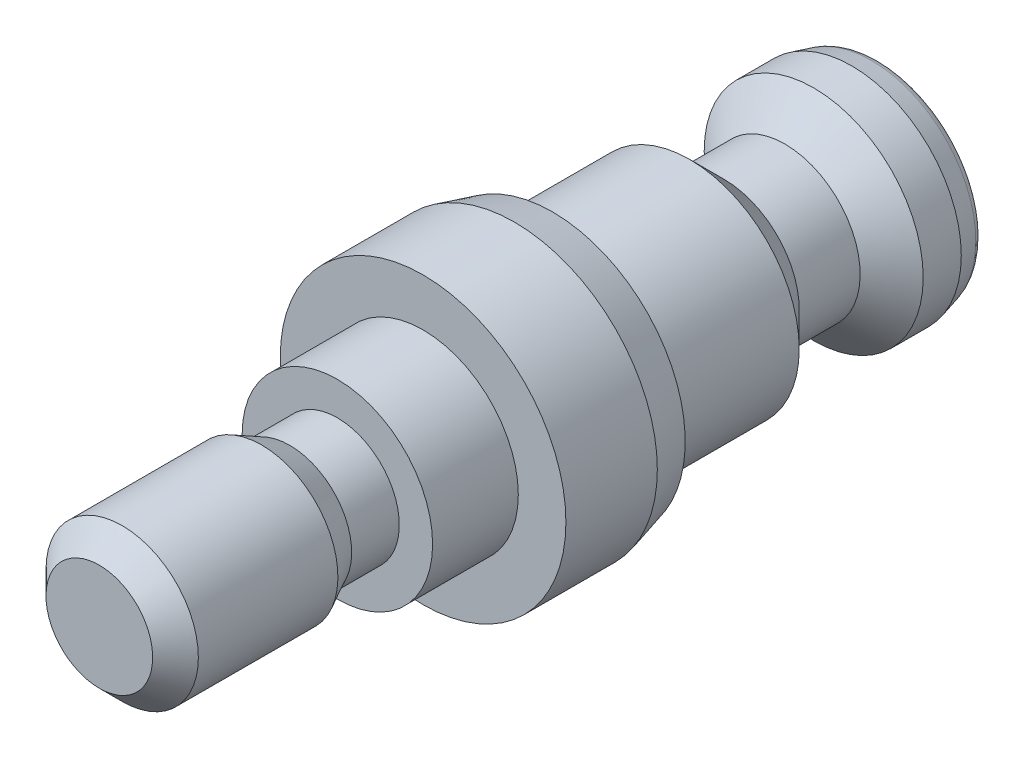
ISO-10303-21;
HEADER;
FILE_DESCRIPTION(('STEP AP214'),'2;1');
FILE_NAME('part.step','',(''),(''),'','','');
FILE_SCHEMA(('AUTOMOTIVE_DESIGN { 1 0 10303 214 1 1 1 1 }'));
ENDSEC;
DATA;
#1=APPLICATION_CONTEXT('core data for automotive mechanical design processes');
#2=APPLICATION_PROTOCOL_DEFINITION('international standard','automotive_design',2000,#1);
#3=PRODUCT_CONTEXT('',#1,'mechanical');
#4=PRODUCT('Part','Part','',(#3));
#5=PRODUCT_RELATED_PRODUCT_CATEGORY('part','',(#4));
#6=PRODUCT_DEFINITION_FORMATION('','',#4);
#7=PRODUCT_DEFINITION_CONTEXT('part definition',#1,'design');
#8=PRODUCT_DEFINITION('design','',#6,#7);
#9=PRODUCT_DEFINITION_SHAPE('','',#8);
#10=(LENGTH_UNIT() NAMED_UNIT(*) SI_UNIT(.MILLI.,.METRE.));
#11=(NAMED_UNIT(*) PLANE_ANGLE_UNIT() SI_UNIT($,.RADIAN.));
#12=(NAMED_UNIT(*) SI_UNIT($,.STERADIAN.) SOLID_ANGLE_UNIT());
#13=UNCERTAINTY_MEASURE_WITH_UNIT(LENGTH_MEASURE(1.E-05),#10,'distance_accuracy_value','');
#14=(GEOMETRIC_REPRESENTATION_CONTEXT(3) GLOBAL_UNCERTAINTY_ASSIGNED_CONTEXT((#13)) GLOBAL_UNIT_ASSIGNED_CONTEXT((#10,
#11,#12)) REPRESENTATION_CONTEXT('',''));
#15=CARTESIAN_POINT('',(0.,0.,0.));
#16=DIRECTION('',(0.,0.,1.));
#17=DIRECTION('',(1.,0.,0.));
#18=AXIS2_PLACEMENT_3D('',#15,#16,#17);
#19=CARTESIAN_POINT('',(0.,0.,0.));
#20=DIRECTION('',(0.,0.,-1.));
#21=DIRECTION('',(0.,1.,0.));
#22=AXIS2_PLACEMENT_3D('',#19,#20,#21);
#23=CYLINDRICAL_SURFACE('',#22,5.75);
#24=CARTESIAN_POINT('',(0.,0.,-14.));
#25=DIRECTION('',(0.,0.,-1.));
#26=DIRECTION('',(0.,1.,0.));
#27=AXIS2_PLACEMENT_3D('',#24,#25,#26);
#28=CIRCLE('',#27,5.75);
#29=CARTESIAN_POINT('',(0.,5.75000000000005,-14.));
#30=VERTEX_POINT('',#29);
#31=EDGE_CURVE('E151',#30,#30,#28,.T.);
#32=ORIENTED_EDGE('',*,*,#31,.F.);
#33=EDGE_LOOP('',(#32));
#34=FACE_BOUND('',#33,.T.);
#35=CARTESIAN_POINT('',(0.,0.,-6.8));
#36=DIRECTION('',(0.,0.,1.));
#37=DIRECTION('',(0.,-1.,0.));
#38=AXIS2_PLACEMENT_3D('',#35,#36,#37);
#39=CIRCLE('',#38,5.75);
#40=CARTESIAN_POINT('',(0.,-5.74999999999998,-6.80000000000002));
#41=VERTEX_POINT('',#40);
#42=EDGE_CURVE('E136',#41,#41,#39,.T.);
#43=ORIENTED_EDGE('',*,*,#42,.F.);
#44=EDGE_LOOP('',(#43));
#45=FACE_BOUND('',#44,.T.);
#46=ADVANCED_FACE('F14',(#34,#45),#23,.T.);
#47=CARTESIAN_POINT('',(0.,0.,-15.8));
#48=DIRECTION('',(0.,0.,1.));
#49=DIRECTION('',(0.,-1.,0.));
#50=AXIS2_PLACEMENT_3D('',#47,#48,#49);
#51=CONICAL_SURFACE('',#50,3.95,0.785398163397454);
#52=ORIENTED_EDGE('',*,*,#31,.T.);
#53=EDGE_LOOP('',(#52));
#54=FACE_BOUND('',#53,.T.);
#55=CARTESIAN_POINT('',(0.,0.,-15.8));
#56=DIRECTION('',(0.,0.,-1.));
#57=DIRECTION('',(0.,1.,0.));
#58=AXIS2_PLACEMENT_3D('',#55,#56,#57);
#59=CIRCLE('',#58,3.95);
#60=CARTESIAN_POINT('',(0.,3.95000000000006,-15.8));
#61=VERTEX_POINT('',#60);
#62=EDGE_CURVE('E148',#61,#61,#59,.T.);
#63=ORIENTED_EDGE('',*,*,#62,.F.);
#64=EDGE_LOOP('',(#63));
#65=FACE_BOUND('',#64,.T.);
#66=ADVANCED_FACE('F185',(#54,#65),#51,.T.);
#67=CARTESIAN_POINT('',(0.,0.,0.));
#68=DIRECTION('',(0.,0.,-1.));
#69=DIRECTION('',(0.,1.,0.));
#70=AXIS2_PLACEMENT_3D('',#67,#68,#69);
#71=CYLINDRICAL_SURFACE('',#70,3.95);
#72=ORIENTED_EDGE('',*,*,#62,.T.);
#73=EDGE_LOOP('',(#72));
#74=FACE_BOUND('',#73,.T.);
#75=CARTESIAN_POINT('',(0.,0.,-19.));
#76=DIRECTION('',(0.,0.,-1.));
#77=DIRECTION('',(0.,1.,0.));
#78=AXIS2_PLACEMENT_3D('',#75,#76,#77);
#79=CIRCLE('',#78,3.95);
#80=CARTESIAN_POINT('',(0.,3.95000000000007,-19.));
#81=VERTEX_POINT('',#80);
#82=EDGE_CURVE('E145',#81,#81,#79,.T.);
#83=ORIENTED_EDGE('',*,*,#82,.F.);
#84=EDGE_LOOP('',(#83));
#85=FACE_BOUND('',#84,.T.);
#86=ADVANCED_FACE('F192',(#74,#85),#71,.T.);
#87=CARTESIAN_POINT('',(0.,0.,-20.5103793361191));
#88=DIRECTION('',(0.,0.,-1.));
#89=DIRECTION('',(0.,1.,0.));
#90=AXIS2_PLACEMENT_3D('',#87,#88,#89);
#91=CONICAL_SURFACE('',#90,5.75,0.872664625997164);
#92=ORIENTED_EDGE('',*,*,#82,.T.);
#93=EDGE_LOOP('',(#92));
#94=FACE_BOUND('',#93,.T.);
#95=CARTESIAN_POINT('',(0.,0.,-20.5103793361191));
#96=DIRECTION('',(0.,0.,-1.));
#97=DIRECTION('',(0.,1.,0.));
#98=AXIS2_PLACEMENT_3D('',#95,#96,#97);
#99=CIRCLE('',#98,5.75);
#100=CARTESIAN_POINT('',(0.,5.75000000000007,-20.5103793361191));
#101=VERTEX_POINT('',#100);
#102=EDGE_CURVE('E142',#101,#101,#99,.T.);
#103=ORIENTED_EDGE('',*,*,#102,.F.);
#104=EDGE_LOOP('',(#103));
#105=FACE_BOUND('',#104,.T.);
#106=ADVANCED_FACE('F244',(#94,#105),#91,.T.);
#107=CARTESIAN_POINT('',(0.,0.,0.));
#108=DIRECTION('',(0.,0.,-1.));
#109=DIRECTION('',(0.,1.,0.));
#110=AXIS2_PLACEMENT_3D('',#107,#108,#109);
#111=CYLINDRICAL_SURFACE('',#110,5.75);
#112=ORIENTED_EDGE('',*,*,#102,.T.);
#113=EDGE_LOOP('',(#112));
#114=FACE_BOUND('',#113,.T.);
#115=CARTESIAN_POINT('',(0.,0.,-22.5103793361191));
#116=DIRECTION('',(0.,0.,-1.));
#117=DIRECTION('',(0.,1.,0.));
#118=AXIS2_PLACEMENT_3D('',#115,#116,#117);
#119=CIRCLE('',#118,5.75);
#120=CARTESIAN_POINT('',(0.,5.75000000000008,-22.5103793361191));
#121=VERTEX_POINT('',#120);
#122=EDGE_CURVE('E139',#121,#121,#119,.T.);
#123=ORIENTED_EDGE('',*,*,#122,.F.);
#124=EDGE_LOOP('',(#123));
#125=FACE_BOUND('',#124,.T.);
#126=ADVANCED_FACE('F235',(#114,#125),#111,.T.);
#127=CARTESIAN_POINT('',(0.,0.,-24.));
#128=DIRECTION('',(0.,0.,1.));
#129=DIRECTION('',(0.,-1.,0.));
#130=AXIS2_PLACEMENT_3D('',#127,#128,#129);
#131=CONICAL_SURFACE('',#130,5.3508573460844,0.26179938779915);
#132=CARTESIAN_POINT('',(0.,0.,-23.5552914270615));
#133=DIRECTION('',(0.,0.,-1.));
#134=DIRECTION('',(0.,1.,0.));
#135=AXIS2_PLACEMENT_3D('',#132,#133,#134);
#136=CIRCLE('',#135,5.47001664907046);
#137=CARTESIAN_POINT('',(0.,5.47001664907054,-23.5552914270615));
#138=VERTEX_POINT('',#137);
#139=EDGE_CURVE('E166',#138,#138,#136,.F.);
#140=ORIENTED_EDGE('',*,*,#139,.T.);
#141=EDGE_LOOP('',(#140));
#142=FACE_BOUND('',#141,.T.);
#143=ORIENTED_EDGE('',*,*,#122,.T.);
#144=EDGE_LOOP('',(#143));
#145=FACE_BOUND('',#144,.T.);
#146=ADVANCED_FACE('F225',(#142,#145),#131,.T.);
#147=CARTESIAN_POINT('',(5.3508573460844,0.,-24.));
#148=DIRECTION('',(0.,0.,-1.));
#149=DIRECTION('',(0.,1.,0.));
#150=AXIS2_PLACEMENT_3D('',#147,#148,#149);
#151=PLANE('',#150);
#152=DIRECTION('',(0.5,-0.86602540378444,0.));
#153=VECTOR('',#152,1.);
#154=CARTESIAN_POINT('',(1.15470053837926,2.00000000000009,-24.));
#155=LINE('',#154,#153);
#156=CARTESIAN_POINT('',(1.15470053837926,2.00000000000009,-24.));
#157=VERTEX_POINT('',#156);
#158=CARTESIAN_POINT('',(2.3094010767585,0.,-24.));
#159=VERTEX_POINT('',#158);
#160=EDGE_CURVE('E29',#157,#159,#155,.T.);
#161=ORIENTED_EDGE('',*,*,#160,.F.);
#162=DIRECTION('',(1.,0.,0.));
#163=VECTOR('',#162,1.);
#164=CARTESIAN_POINT('',(-1.15470053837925,2.00000000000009,-24.));
#165=LINE('',#164,#163);
#166=CARTESIAN_POINT('',(-1.15470053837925,2.00000000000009,-24.));
#167=VERTEX_POINT('',#166);
#168=EDGE_CURVE('E112',#167,#157,#165,.T.);
#169=ORIENTED_EDGE('',*,*,#168,.F.);
#170=DIRECTION('',(0.5,0.866025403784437,0.));
#171=VECTOR('',#170,1.);
#172=CARTESIAN_POINT('',(-2.30940107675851,0.,-24.));
#173=LINE('',#172,#171);
#174=CARTESIAN_POINT('',(-2.30940107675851,0.,-24.));
#175=VERTEX_POINT('',#174);
#176=EDGE_CURVE('E110',#175,#167,#173,.T.);
#177=ORIENTED_EDGE('',*,*,#176,.F.);
#178=DIRECTION('',(-0.5,0.866025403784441,0.));
#179=VECTOR('',#178,1.);
#180=CARTESIAN_POINT('',(-1.15470053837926,-1.99999999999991,-24.));
#181=LINE('',#180,#179);
#182=CARTESIAN_POINT('',(-1.15470053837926,-1.99999999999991,-24.));
#183=VERTEX_POINT('',#182);
#184=EDGE_CURVE('E77',#183,#175,#181,.T.);
#185=ORIENTED_EDGE('',*,*,#184,.F.);
#186=DIRECTION('',(-1.,0.,0.));
#187=VECTOR('',#186,1.);
#188=CARTESIAN_POINT('',(1.15470053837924,-1.99999999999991,-24.));
#189=LINE('',#188,#187);
#190=CARTESIAN_POINT('',(1.15470053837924,-1.99999999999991,-24.));
#191=VERTEX_POINT('',#190);
#192=EDGE_CURVE('E106',#191,#183,#189,.T.);
#193=ORIENTED_EDGE('',*,*,#192,.F.);
#194=DIRECTION('',(-0.5,-0.866025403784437,0.));
#195=VECTOR('',#194,1.);
#196=CARTESIAN_POINT('',(2.3094010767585,0.,-24.));
#197=LINE('',#196,#195);
#198=EDGE_CURVE('E103',#159,#191,#197,.T.);
#199=ORIENTED_EDGE('',*,*,#198,.F.);
#200=EDGE_LOOP('',(#161,#169,#177,#185,#193,#199));
#201=FACE_BOUND('',#200,.T.);
#202=CARTESIAN_POINT('',(0.,0.,-24.));
#203=DIRECTION('',(0.,0.,-1.));
#204=DIRECTION('',(0.,1.,0.));
#205=AXIS2_PLACEMENT_3D('',#202,#203,#204);
#206=CIRCLE('',#205,4.89046115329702);
#207=CARTESIAN_POINT('',(0.,4.8904611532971,-24.));
#208=VERTEX_POINT('',#207);
#209=EDGE_CURVE('E163',#208,#208,#206,.T.);
#210=ORIENTED_EDGE('',*,*,#209,.T.);
#211=EDGE_LOOP('',(#210));
#212=FACE_BOUND('',#211,.T.);
#213=ADVANCED_FACE('F222',(#201,#212),#151,.T.);
#214=CARTESIAN_POINT('',(5.75,0.,-6.8));
#215=DIRECTION('',(0.,0.,1.));
#216=DIRECTION('',(0.,-1.,0.));
#217=AXIS2_PLACEMENT_3D('',#214,#215,#216);
#218=PLANE('',#217);
#219=CARTESIAN_POINT('',(0.,0.,-6.8));
#220=DIRECTION('',(0.,0.,1.));
#221=DIRECTION('',(0.,-1.,0.));
#222=AXIS2_PLACEMENT_3D('',#219,#220,#221);
#223=CIRCLE('',#222,6.96410161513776);
#224=CARTESIAN_POINT('',(0.,-6.96410161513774,-6.80000000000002));
#225=VERTEX_POINT('',#224);
#226=EDGE_CURVE('E9',#225,#225,#223,.F.);
#227=ORIENTED_EDGE('',*,*,#226,.T.);
#228=EDGE_LOOP('',(#227));
#229=FACE_BOUND('',#228,.T.);
#230=ORIENTED_EDGE('',*,*,#42,.T.);
#231=EDGE_LOOP('',(#230));
#232=FACE_BOUND('',#231,.T.);
#233=ADVANCED_FACE('F224',(#229,#232),#218,.F.);
#234=CARTESIAN_POINT('',(0.,0.,0.));
#235=DIRECTION('',(0.,0.,1.));
#236=DIRECTION('',(0.,-1.,0.));
#237=AXIS2_PLACEMENT_3D('',#234,#235,#236);
#238=CYLINDRICAL_SURFACE('',#237,7.5);
#239=CARTESIAN_POINT('',(0.,0.,-4.8));
#240=DIRECTION('',(0.,0.,1.));
#241=DIRECTION('',(0.,-1.,0.));
#242=AXIS2_PLACEMENT_3D('',#239,#240,#241);
#243=CIRCLE('',#242,7.5);
#244=CARTESIAN_POINT('',(0.,-7.49999999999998,-4.80000000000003));
#245=VERTEX_POINT('',#244);
#246=EDGE_CURVE('E22',#245,#245,#243,.T.);
#247=ORIENTED_EDGE('',*,*,#246,.T.);
#248=EDGE_LOOP('',(#247));
#249=FACE_BOUND('',#248,.T.);
#250=CARTESIAN_POINT('',(0.,0.,0.));
#251=DIRECTION('',(0.,0.,1.));
#252=DIRECTION('',(0.,-1.,0.));
#253=AXIS2_PLACEMENT_3D('',#250,#251,#252);
#254=CIRCLE('',#253,7.5);
#255=CARTESIAN_POINT('',(0.,-7.5,0.));
#256=VERTEX_POINT('',#255);
#257=EDGE_CURVE('E133',#256,#256,#254,.T.);
#258=ORIENTED_EDGE('',*,*,#257,.F.);
#259=EDGE_LOOP('',(#258));
#260=FACE_BOUND('',#259,.T.);
#261=ADVANCED_FACE('F171',(#249,#260),#238,.T.);
#262=CARTESIAN_POINT('',(0.,0.,0.));
#263=DIRECTION('',(0.,0.,1.));
#264=DIRECTION('',(0.,-1.,0.));
#265=AXIS2_PLACEMENT_3D('',#262,#263,#264);
#266=PLANE('',#265);
#267=CARTESIAN_POINT('',(0.,0.,0.));
#268=DIRECTION('',(0.,0.,1.));
#269=DIRECTION('',(0.,-1.,0.));
#270=AXIS2_PLACEMENT_3D('',#267,#268,#269);
#271=CIRCLE('',#270,5.);
#272=CARTESIAN_POINT('',(0.,-5.,0.));
#273=VERTEX_POINT('',#272);
#274=EDGE_CURVE('E154',#273,#273,#271,.T.);
#275=ORIENTED_EDGE('',*,*,#274,.F.);
#276=EDGE_LOOP('',(#275));
#277=FACE_BOUND('',#276,.T.);
#278=ORIENTED_EDGE('',*,*,#257,.T.);
#279=EDGE_LOOP('',(#278));
#280=FACE_BOUND('',#279,.T.);
#281=ADVANCED_FACE('F199',(#277,#280),#266,.T.);
#282=CARTESIAN_POINT('',(4.,0.,4.5));
#283=DIRECTION('',(0.,0.,1.));
#284=DIRECTION('',(0.,-1.,0.));
#285=AXIS2_PLACEMENT_3D('',#282,#283,#284);
#286=PLANE('',#285);
#287=CARTESIAN_POINT('',(0.,0.,4.5));
#288=DIRECTION('',(0.,0.,-1.));
#289=DIRECTION('',(0.,1.,0.));
#290=AXIS2_PLACEMENT_3D('',#287,#288,#289);
#291=CIRCLE('',#290,5.);
#292=CARTESIAN_POINT('',(0.,4.99999999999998,4.50000000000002));
#293=VERTEX_POINT('',#292);
#294=EDGE_CURVE('E130',#293,#293,#291,.T.);
#295=ORIENTED_EDGE('',*,*,#294,.F.);
#296=EDGE_LOOP('',(#295));
#297=FACE_BOUND('',#296,.T.);
#298=CARTESIAN_POINT('',(0.,0.,4.5));
#299=DIRECTION('',(0.,0.,-1.));
#300=DIRECTION('',(0.,1.,0.));
#301=AXIS2_PLACEMENT_3D('',#298,#299,#300);
#302=CIRCLE('',#301,3.25);
#303=CARTESIAN_POINT('',(0.,3.24999999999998,4.50000000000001));
#304=VERTEX_POINT('',#303);
#305=EDGE_CURVE('E116',#304,#304,#302,.T.);
#306=ORIENTED_EDGE('',*,*,#305,.T.);
#307=EDGE_LOOP('',(#306));
#308=FACE_BOUND('',#307,.T.);
#309=ADVANCED_FACE('F202',(#297,#308),#286,.T.);
#310=CARTESIAN_POINT('',(0.,0.,0.));
#311=DIRECTION('',(0.,0.,-1.));
#312=DIRECTION('',(0.,1.,0.));
#313=AXIS2_PLACEMENT_3D('',#310,#311,#312);
#314=CYLINDRICAL_SURFACE('',#313,5.);
#315=ORIENTED_EDGE('',*,*,#294,.T.);
#316=EDGE_LOOP('',(#315));
#317=FACE_BOUND('',#316,.T.);
#318=ORIENTED_EDGE('',*,*,#274,.T.);
#319=EDGE_LOOP('',(#318));
#320=FACE_BOUND('',#319,.T.);
#321=ADVANCED_FACE('F411',(#317,#320),#314,.T.);
#322=CARTESIAN_POINT('',(0.,0.,8.47195787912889));
#323=DIRECTION('',(0.,0.,1.));
#324=DIRECTION('',(0.,-1.,0.));
#325=AXIS2_PLACEMENT_3D('',#322,#323,#324);
#326=CONICAL_SURFACE('',#325,4.,0.471238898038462);
#327=CARTESIAN_POINT('',(0.,0.,7.));
#328=DIRECTION('',(0.,0.,-1.));
#329=DIRECTION('',(0.,1.,0.));
#330=AXIS2_PLACEMENT_3D('',#327,#328,#329);
#331=CIRCLE('',#330,3.25);
#332=CARTESIAN_POINT('',(0.,3.24999999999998,7.00000000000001));
#333=VERTEX_POINT('',#332);
#334=EDGE_CURVE('E124',#333,#333,#331,.T.);
#335=ORIENTED_EDGE('',*,*,#334,.F.);
#336=EDGE_LOOP('',(#335));
#337=FACE_BOUND('',#336,.T.);
#338=CARTESIAN_POINT('',(0.,0.,8.47195787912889));
#339=DIRECTION('',(0.,0.,-1.));
#340=DIRECTION('',(0.,1.,0.));
#341=AXIS2_PLACEMENT_3D('',#338,#339,#340);
#342=CIRCLE('',#341,4.);
#343=CARTESIAN_POINT('',(0.,3.99999999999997,8.4719578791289));
#344=VERTEX_POINT('',#343);
#345=EDGE_CURVE('E127',#344,#344,#342,.T.);
#346=ORIENTED_EDGE('',*,*,#345,.T.);
#347=EDGE_LOOP('',(#346));
#348=FACE_BOUND('',#347,.T.);
#349=ADVANCED_FACE('F401',(#337,#348),#326,.T.);
#350=CARTESIAN_POINT('',(0.,0.,0.));
#351=DIRECTION('',(0.,0.,-1.));
#352=DIRECTION('',(0.,1.,0.));
#353=AXIS2_PLACEMENT_3D('',#350,#351,#352);
#354=CYLINDRICAL_SURFACE('',#353,3.25);
#355=ORIENTED_EDGE('',*,*,#305,.F.);
#356=EDGE_LOOP('',(#355));
#357=FACE_BOUND('',#356,.T.);
#358=ORIENTED_EDGE('',*,*,#334,.T.);
#359=EDGE_LOOP('',(#358));
#360=FACE_BOUND('',#359,.T.);
#361=ADVANCED_FACE('F392',(#357,#360),#354,.T.);
#362=CARTESIAN_POINT('',(0.,0.,17.));
#363=DIRECTION('',(0.,0.,1.));
#364=DIRECTION('',(0.,-1.,0.));
#365=AXIS2_PLACEMENT_3D('',#362,#363,#364);
#366=PLANE('',#365);
#367=CARTESIAN_POINT('',(0.,0.,17.));
#368=DIRECTION('',(0.,0.,1.));
#369=DIRECTION('',(0.,-1.,0.));
#370=AXIS2_PLACEMENT_3D('',#367,#368,#369);
#371=CIRCLE('',#370,2.8);
#372=CARTESIAN_POINT('',(0.,-2.80000000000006,17.));
#373=VERTEX_POINT('',#372);
#374=EDGE_CURVE('E160',#373,#373,#371,.T.);
#375=ORIENTED_EDGE('',*,*,#374,.T.);
#376=EDGE_LOOP('',(#375));
#377=FACE_BOUND('',#376,.T.);
#378=ADVANCED_FACE('F239',(#377),#366,.T.);
#379=CARTESIAN_POINT('',(0.,0.,0.));
#380=DIRECTION('',(0.,0.,-1.));
#381=DIRECTION('',(0.,1.,0.));
#382=AXIS2_PLACEMENT_3D('',#379,#380,#381);
#383=CYLINDRICAL_SURFACE('',#382,4.);
#384=CARTESIAN_POINT('',(0.,0.,15.8));
#385=DIRECTION('',(0.,0.,1.));
#386=DIRECTION('',(0.,-1.,0.));
#387=AXIS2_PLACEMENT_3D('',#384,#385,#386);
#388=CIRCLE('',#387,4.);
#389=CARTESIAN_POINT('',(0.,-4.00000000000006,15.8));
#390=VERTEX_POINT('',#389);
#391=EDGE_CURVE('E157',#390,#390,#388,.F.);
#392=ORIENTED_EDGE('',*,*,#391,.T.);
#393=EDGE_LOOP('',(#392));
#394=FACE_BOUND('',#393,.T.);
#395=ORIENTED_EDGE('',*,*,#345,.F.);
#396=EDGE_LOOP('',(#395));
#397=FACE_BOUND('',#396,.T.);
#398=ADVANCED_FACE('F207',(#394,#397),#383,.T.);
#399=CARTESIAN_POINT('',(0.,0.,15.8));
#400=DIRECTION('',(0.,0.,-1.));
#401=DIRECTION('',(0.,1.,0.));
#402=AXIS2_PLACEMENT_3D('',#399,#400,#401);
#403=CONICAL_SURFACE('',#402,4.,0.78539816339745);
#404=ORIENTED_EDGE('',*,*,#374,.F.);
#405=EDGE_LOOP('',(#404));
#406=FACE_BOUND('',#405,.T.);
#407=ORIENTED_EDGE('',*,*,#391,.F.);
#408=EDGE_LOOP('',(#407));
#409=FACE_BOUND('',#408,.T.);
#410=ADVANCED_FACE('F204',(#406,#409),#403,.T.);
#411=CARTESIAN_POINT('',(0.,0.,-23.4));
#412=DIRECTION('',(0.,0.,-1.));
#413=DIRECTION('',(0.,1.,0.));
#414=AXIS2_PLACEMENT_3D('',#411,#412,#413);
#415=TOROIDAL_SURFACE('',#414,4.89046115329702,0.6);
#416=ORIENTED_EDGE('',*,*,#139,.F.);
#417=EDGE_LOOP('',(#416));
#418=FACE_BOUND('',#417,.T.);
#419=ORIENTED_EDGE('',*,*,#209,.F.);
#420=EDGE_LOOP('',(#419));
#421=FACE_BOUND('',#420,.T.);
#422=ADVANCED_FACE('F206',(#418,#421),#415,.T.);
#423=CARTESIAN_POINT('',(1.15470053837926,2.00000000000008,-21.));
#424=DIRECTION('',(0.86602540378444,0.5,0.));
#425=DIRECTION('',(-0.5,0.86602540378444,0.));
#426=AXIS2_PLACEMENT_3D('',#423,#424,#425);
#427=PLANE('',#426);
#428=ORIENTED_EDGE('',*,*,#160,.T.);
#429=DIRECTION('',(0.,0.,-1.));
#430=VECTOR('',#429,1.);
#431=CARTESIAN_POINT('',(2.3094010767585,0.,-21.));
#432=LINE('',#431,#430);
#433=CARTESIAN_POINT('',(2.3094010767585,0.,-21.));
#434=VERTEX_POINT('',#433);
#435=EDGE_CURVE('E59',#434,#159,#432,.T.);
#436=ORIENTED_EDGE('',*,*,#435,.F.);
#437=DIRECTION('',(0.5,-0.86602540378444,0.));
#438=VECTOR('',#437,1.);
#439=CARTESIAN_POINT('',(1.15470053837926,2.00000000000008,-21.));
#440=LINE('',#439,#438);
#441=CARTESIAN_POINT('',(1.15470053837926,2.00000000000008,-21.));
#442=VERTEX_POINT('',#441);
#443=EDGE_CURVE('E114',#442,#434,#440,.T.);
#444=ORIENTED_EDGE('',*,*,#443,.F.);
#445=DIRECTION('',(0.,0.,-1.));
#446=VECTOR('',#445,1.);
#447=CARTESIAN_POINT('',(1.15470053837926,2.00000000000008,-21.));
#448=LINE('',#447,#446);
#449=EDGE_CURVE('E37',#442,#157,#448,.T.);
#450=ORIENTED_EDGE('',*,*,#449,.T.);
#451=EDGE_LOOP('',(#428,#436,#444,#450));
#452=FACE_BOUND('',#451,.T.);
#453=ADVANCED_FACE('F210',(#452),#427,.F.);
#454=CARTESIAN_POINT('',(-1.15470053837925,2.00000000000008,-21.));
#455=DIRECTION('',(0.,1.,0.));
#456=DIRECTION('',(-1.,0.,0.));
#457=AXIS2_PLACEMENT_3D('',#454,#455,#456);
#458=PLANE('',#457);
#459=ORIENTED_EDGE('',*,*,#168,.T.);
#460=ORIENTED_EDGE('',*,*,#449,.F.);
#461=DIRECTION('',(1.,0.,0.));
#462=VECTOR('',#461,1.);
#463=CARTESIAN_POINT('',(-1.15470053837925,2.00000000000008,-21.));
#464=LINE('',#463,#462);
#465=CARTESIAN_POINT('',(-1.15470053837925,2.00000000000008,-21.));
#466=VERTEX_POINT('',#465);
#467=EDGE_CURVE('E89',#466,#442,#464,.T.);
#468=ORIENTED_EDGE('',*,*,#467,.F.);
#469=DIRECTION('',(0.,0.,-1.));
#470=VECTOR('',#469,1.);
#471=CARTESIAN_POINT('',(-1.15470053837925,2.00000000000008,-21.));
#472=LINE('',#471,#470);
#473=EDGE_CURVE('E81',#466,#167,#472,.T.);
#474=ORIENTED_EDGE('',*,*,#473,.T.);
#475=EDGE_LOOP('',(#459,#460,#468,#474));
#476=FACE_BOUND('',#475,.T.);
#477=ADVANCED_FACE('F216',(#476),#458,.F.);
#478=CARTESIAN_POINT('',(-2.30940107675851,0.,-21.));
#479=DIRECTION('',(-0.866025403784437,0.5,0.));
#480=DIRECTION('',(-0.5,-0.866025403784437,0.));
#481=AXIS2_PLACEMENT_3D('',#478,#479,#480);
#482=PLANE('',#481);
#483=ORIENTED_EDGE('',*,*,#176,.T.);
#484=ORIENTED_EDGE('',*,*,#473,.F.);
#485=DIRECTION('',(0.5,0.866025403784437,0.));
#486=VECTOR('',#485,1.);
#487=CARTESIAN_POINT('',(-2.30940107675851,0.,-21.));
#488=LINE('',#487,#486);
#489=CARTESIAN_POINT('',(-2.30940107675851,0.,-21.));
#490=VERTEX_POINT('',#489);
#491=EDGE_CURVE('E85',#490,#466,#488,.T.);
#492=ORIENTED_EDGE('',*,*,#491,.F.);
#493=DIRECTION('',(0.,0.,-1.));
#494=VECTOR('',#493,1.);
#495=CARTESIAN_POINT('',(-2.30940107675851,0.,-21.));
#496=LINE('',#495,#494);
#497=EDGE_CURVE('E70',#490,#175,#496,.T.);
#498=ORIENTED_EDGE('',*,*,#497,.T.);
#499=EDGE_LOOP('',(#483,#484,#492,#498));
#500=FACE_BOUND('',#499,.T.);
#501=ADVANCED_FACE('F86',(#500),#482,.F.);
#502=CARTESIAN_POINT('',(-1.15470053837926,-1.99999999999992,-21.));
#503=DIRECTION('',(-0.86602540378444,-0.5,0.));
#504=DIRECTION('',(0.5,-0.866025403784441,0.));
#505=AXIS2_PLACEMENT_3D('',#502,#503,#504);
#506=PLANE('',#505);
#507=ORIENTED_EDGE('',*,*,#184,.T.);
#508=ORIENTED_EDGE('',*,*,#497,.F.);
#509=DIRECTION('',(-0.5,0.866025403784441,0.));
#510=VECTOR('',#509,1.);
#511=CARTESIAN_POINT('',(-1.15470053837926,-1.99999999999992,-21.));
#512=LINE('',#511,#510);
#513=CARTESIAN_POINT('',(-1.15470053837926,-1.99999999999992,-21.));
#514=VERTEX_POINT('',#513);
#515=EDGE_CURVE('E74',#514,#490,#512,.T.);
#516=ORIENTED_EDGE('',*,*,#515,.F.);
#517=DIRECTION('',(0.,0.,-1.));
#518=VECTOR('',#517,1.);
#519=CARTESIAN_POINT('',(-1.15470053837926,-1.99999999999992,-21.));
#520=LINE('',#519,#518);
#521=EDGE_CURVE('E82',#514,#183,#520,.T.);
#522=ORIENTED_EDGE('',*,*,#521,.T.);
#523=EDGE_LOOP('',(#507,#508,#516,#522));
#524=FACE_BOUND('',#523,.T.);
#525=ADVANCED_FACE('F72',(#524),#506,.F.);
#526=CARTESIAN_POINT('',(1.15470053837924,-1.99999999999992,-21.));
#527=DIRECTION('',(0.,-1.,0.));
#528=DIRECTION('',(1.,0.,0.));
#529=AXIS2_PLACEMENT_3D('',#526,#527,#528);
#530=PLANE('',#529);
#531=ORIENTED_EDGE('',*,*,#192,.T.);
#532=ORIENTED_EDGE('',*,*,#521,.F.);
#533=DIRECTION('',(-1.,0.,0.));
#534=VECTOR('',#533,1.);
#535=CARTESIAN_POINT('',(1.15470053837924,-1.99999999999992,-21.));
#536=LINE('',#535,#534);
#537=CARTESIAN_POINT('',(1.15470053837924,-1.99999999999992,-21.));
#538=VERTEX_POINT('',#537);
#539=EDGE_CURVE('E95',#538,#514,#536,.T.);
#540=ORIENTED_EDGE('',*,*,#539,.F.);
#541=DIRECTION('',(0.,0.,-1.));
#542=VECTOR('',#541,1.);
#543=CARTESIAN_POINT('',(1.15470053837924,-1.99999999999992,-21.));
#544=LINE('',#543,#542);
#545=EDGE_CURVE('E119',#538,#191,#544,.T.);
#546=ORIENTED_EDGE('',*,*,#545,.T.);
#547=EDGE_LOOP('',(#531,#532,#540,#546));
#548=FACE_BOUND('',#547,.T.);
#549=ADVANCED_FACE('F350',(#548),#530,.F.);
#550=CARTESIAN_POINT('',(2.3094010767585,0.,-21.));
#551=DIRECTION('',(0.866025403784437,-0.5,0.));
#552=DIRECTION('',(0.5,0.866025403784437,0.));
#553=AXIS2_PLACEMENT_3D('',#550,#551,#552);
#554=PLANE('',#553);
#555=ORIENTED_EDGE('',*,*,#198,.T.);
#556=ORIENTED_EDGE('',*,*,#545,.F.);
#557=DIRECTION('',(-0.5,-0.866025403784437,0.));
#558=VECTOR('',#557,1.);
#559=CARTESIAN_POINT('',(2.3094010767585,0.,-21.));
#560=LINE('',#559,#558);
#561=EDGE_CURVE('E97',#434,#538,#560,.T.);
#562=ORIENTED_EDGE('',*,*,#561,.F.);
#563=ORIENTED_EDGE('',*,*,#435,.T.);
#564=EDGE_LOOP('',(#555,#556,#562,#563));
#565=FACE_BOUND('',#564,.T.);
#566=ADVANCED_FACE('F181',(#565),#554,.F.);
#567=CARTESIAN_POINT('',(0.,0.,-21.));
#568=DIRECTION('',(0.,0.,-1.));
#569=DIRECTION('',(0.,1.,0.));
#570=AXIS2_PLACEMENT_3D('',#567,#568,#569);
#571=PLANE('',#570);
#572=ORIENTED_EDGE('',*,*,#443,.T.);
#573=ORIENTED_EDGE('',*,*,#561,.T.);
#574=ORIENTED_EDGE('',*,*,#539,.T.);
#575=ORIENTED_EDGE('',*,*,#515,.T.);
#576=ORIENTED_EDGE('',*,*,#491,.T.);
#577=ORIENTED_EDGE('',*,*,#467,.T.);
#578=EDGE_LOOP('',(#572,#573,#574,#575,#576,#577));
#579=FACE_BOUND('',#578,.T.);
#580=ADVANCED_FACE('F92',(#579),#571,.T.);
#581=CARTESIAN_POINT('',(0.,0.,-4.8));
#582=DIRECTION('',(0.,0.,1.));
#583=DIRECTION('',(0.,-1.,0.));
#584=AXIS2_PLACEMENT_3D('',#581,#582,#583);
#585=CONICAL_SURFACE('',#584,7.5,0.261799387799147);
#586=ORIENTED_EDGE('',*,*,#226,.F.);
#587=EDGE_LOOP('',(#586));
#588=FACE_BOUND('',#587,.T.);
#589=ORIENTED_EDGE('',*,*,#246,.F.);
#590=EDGE_LOOP('',(#589));
#591=FACE_BOUND('',#590,.T.);
#592=ADVANCED_FACE('F16',(#588,#591),#585,.T.);
#593=CLOSED_SHELL('',(#46,#66,#86,#106,#126,#146,#213,#233,#261,#281,#309,#321,#349,#361,#378,
#398,#410,#422,#453,#477,#501,#525,#549,#566,#580,#592));
#594=MANIFOLD_SOLID_BREP('B1',#593);
#595=ADVANCED_BREP_SHAPE_REPRESENTATION('',(#18,#594),#14);
#596=SHAPE_DEFINITION_REPRESENTATION(#9,#595);
ENDSEC;
END-ISO-10303-21;
